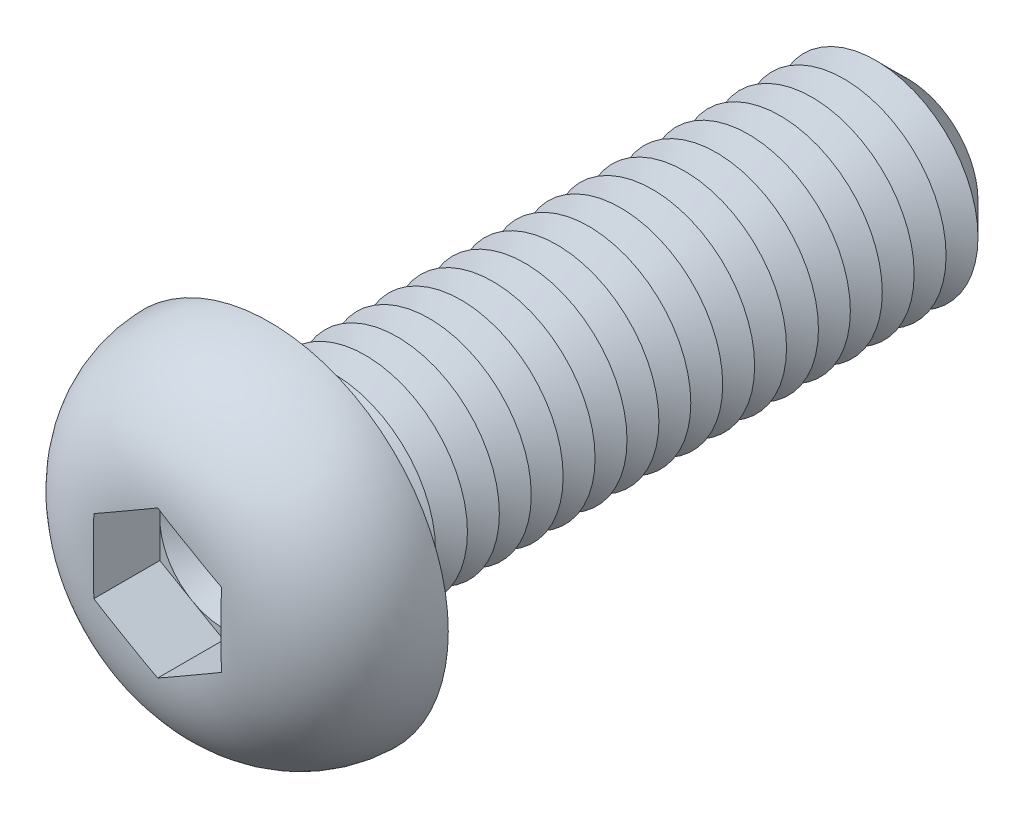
from build123d import *

# Parameters (mm, degrees)
CUT_EXTRUDE1_DEPTH  = 2.6
SKETCH4_R           = 4
BOSS_EXTRUDE1_DEPTH = 25
CHAMFER1_SIZE       = 1.25
LPATTERN1_COUNT     = 18
LPATTERN1_PITCH     = 1.25
FILLET2_R           = 0.5


with BuildPart() as part:
    # Sketch2 → Revolve1 (revolve)
    with BuildSketch(Plane(origin=(0, 0, 0), x_dir=(0, 0, -1), z_dir=(1, 0, 0)), mode=Mode.PRIVATE) as revolve1_sk:
        with BuildLine():
            Line((0, 0), (-4.4, 0))
            Line((-4.4, 0), (-4.4, 2.501111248))
            ThreePointArc((-4.4, 2.501111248), (-3.117141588, 5.647537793), (0, 7))
            Line((0, 7), (0, 0))
        make_face()
    revolve(revolve1_sk.sketch.rotate(Axis((0, 0, 47.934239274), (0, 0, -1)), 90), axis=Axis((0, 0, 47.934239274), (0, 0, -1)))

    # Sketch3 → Cut-Extrude1 (cut)
    with BuildSketch(Plane.XY.offset(4.4)):
        Polygon((0, 2.886751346), (-2.5, 1.443375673), (-2.5, -1.443375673), (0, -2.886751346), (2.5, -1.443375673), (2.5, 1.443375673), align=None)
    extrude(amount=-CUT_EXTRUDE1_DEPTH, mode=Mode.SUBTRACT)

    # Sketch4 → Boss-Extrude1 (add)
    with BuildSketch(Plane(origin=(0, 0, 0), x_dir=(-1, 0, 0), z_dir=(0, 0, -1))):
        with Locations(Location((0, 0, 0), (0, 0, 180))):
            Circle(SKETCH4_R)
    extrude(amount=BOSS_EXTRUDE1_DEPTH)

    # Chamfer1
    chamfer1_edges = [part.edges().sort_by_distance(p)[0] for p in [
        (-4, 0, -25),
    ]]
    chamfer(chamfer1_edges, length=CHAMFER1_SIZE)

    # Sketch5 → Cut-Revolve1 (revolve, cut)
    with BuildSketch(Plane(origin=(0, 0, 0), x_dir=(0, 0, -1), z_dir=(1, 0, 0)), mode=Mode.PRIVATE) as cut_revolve1_sk:
        Polygon((1.25, 4), (2.5, 4), (1.875, 2.917468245), align=None)
    cut_revolve1 = revolve(cut_revolve1_sk.sketch.rotate(Axis((0, 0, 47.934239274), (0, 0, -1)), 90), axis=Axis((0, 0, 47.934239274), (0, 0, -1)), mode=Mode.SUBTRACT)

    # LPattern1: Cut-Revolve1 ×18
    with Locations(*[(0, 0, -i * LPATTERN1_PITCH) for i in range(1, LPATTERN1_COUNT)]):
        add(cut_revolve1, mode=Mode.SUBTRACT)

    # Fillet2
    fillet2_edges = [part.edges().sort_by_distance(p)[0] for p in [
        (-4, 0, 0),
    ]]
    fillet(fillet2_edges, radius=FILLET2_R)

    # Cut-Extrude2 cone 1 section (on through the dimple's axis) → Cut-Extrude2 (revolve, cut)
    with BuildSketch(Plane(origin=(0, 0, 1.8), x_dir=(0, -1, 0), z_dir=(1, 0, 0))):
        Polygon((0, 0), (2.5, 0), (0, 1.443375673), align=None)
    revolve(axis=Axis((0, 0, 1.8), (0, 0, -1)), mode=Mode.SUBTRACT)


solid = part.part
